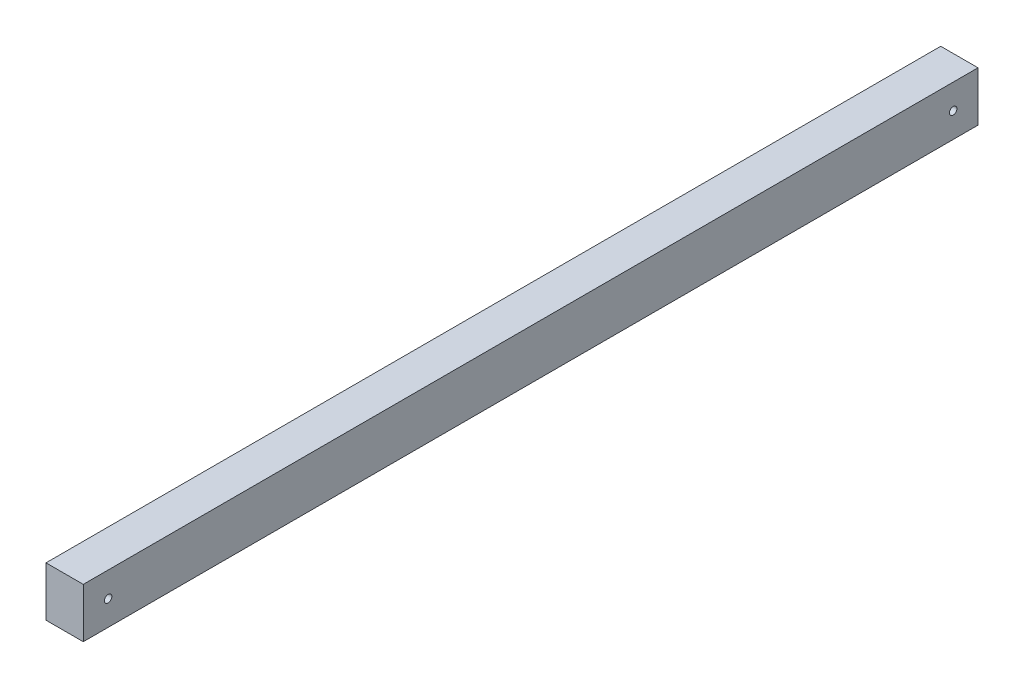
from build123d import *

# Parameters (mm, degrees)
ESQUISSE1_W                  = 30
ESQUISSE1_H                  = 40
BOSS_EXTRU_1_DEPTH           = 360
ENL_V_MAT_EXTRU_1_DEPTH      = 361.867011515
ENL_V_MAT_EXTRU_1_DEPTH_BACK = 361.867011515
ESQUISSE2_R                  = 3


with BuildPart() as part:
    # Esquisse1 → Boss.-Extru.1 (new, symmetric)
    with BuildSketch(Plane.XY):
        Rectangle(ESQUISSE1_W, ESQUISSE1_H)
    extrude(amount=BOSS_EXTRU_1_DEPTH, both=True)

    # Esquisse2 → Enl_v. mat.-Extru.1 (cut, two sides: drawn at the far end of the back side and taken through both)
    with BuildSketch(Plane(origin=(0, 0, 0), x_dir=(0, 0, -1), z_dir=(1, 0, 0)).offset(-ENL_V_MAT_EXTRU_1_DEPTH_BACK)):
        with Locations((-340, 0)):
            Circle(ESQUISSE2_R)
        with Locations((340, 0)):
            Circle(ESQUISSE2_R)
    extrude(amount=ENL_V_MAT_EXTRU_1_DEPTH + ENL_V_MAT_EXTRU_1_DEPTH_BACK, mode=Mode.SUBTRACT)


solid = part.part
